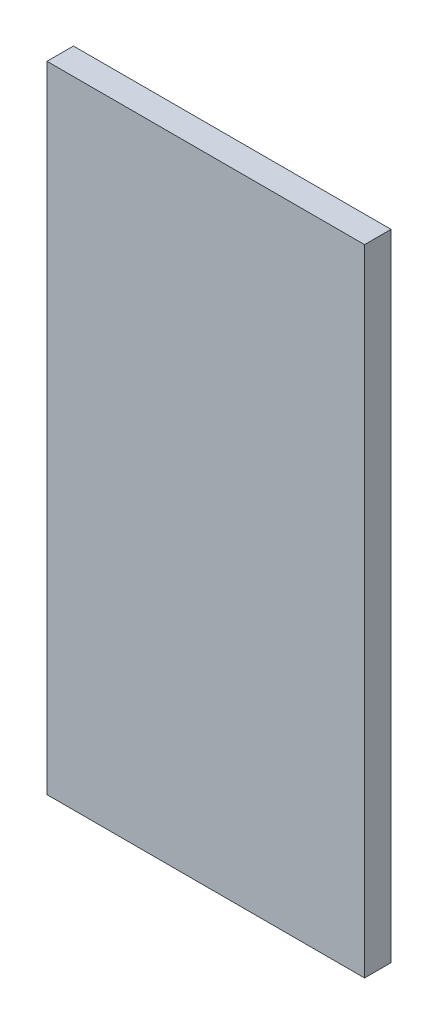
from build123d import *

# Parameters (mm, degrees)
BOSS_EXTRUDE1_DEPTH = 609.6
CUT_EXTRUDE1_REACH  = 1323.777
SKETCH3_W           = 76.2
SKETCH3_H           = 50.8


with BuildPart() as part:
    # Sketch1 → Boss-Extrude1 (new body)
    with BuildSketch(Plane(origin=(0, 0, 0), x_dir=(0, 0, -1), z_dir=(1, 0, 0))):
        Polygon((0, 0), (0, 1219.2), (50.8, 1219.2), (50.8, 1168.4), (101.6, 1168.4), (101.6, 50.8), (50.8, 50.8), (50.8, 0), align=None)
    extrude(amount=BOSS_EXTRUDE1_DEPTH)

    # Sketch3 → Cut-Extrude1 (cut, up to next)
    with BuildSketch(Plane(origin=(0, 1168.4, 0), x_dir=(1, 0, 0), z_dir=(0, 1, 0)), mode=Mode.PRIVATE) as cut_extrude1_sk1:
        with Locations((571.5, 76.2)):
            Rectangle(SKETCH3_W, SKETCH3_H)
    cut_extrude1_tool1 = extrude(cut_extrude1_sk1.sketch, amount=-CUT_EXTRUDE1_REACH, mode=Mode.PRIVATE) & part.part
    add(cut_extrude1_tool1.solids().sort_by_distance((571.5, 1168.4, -76.2))[0], mode=Mode.SUBTRACT)


solid = part.part
